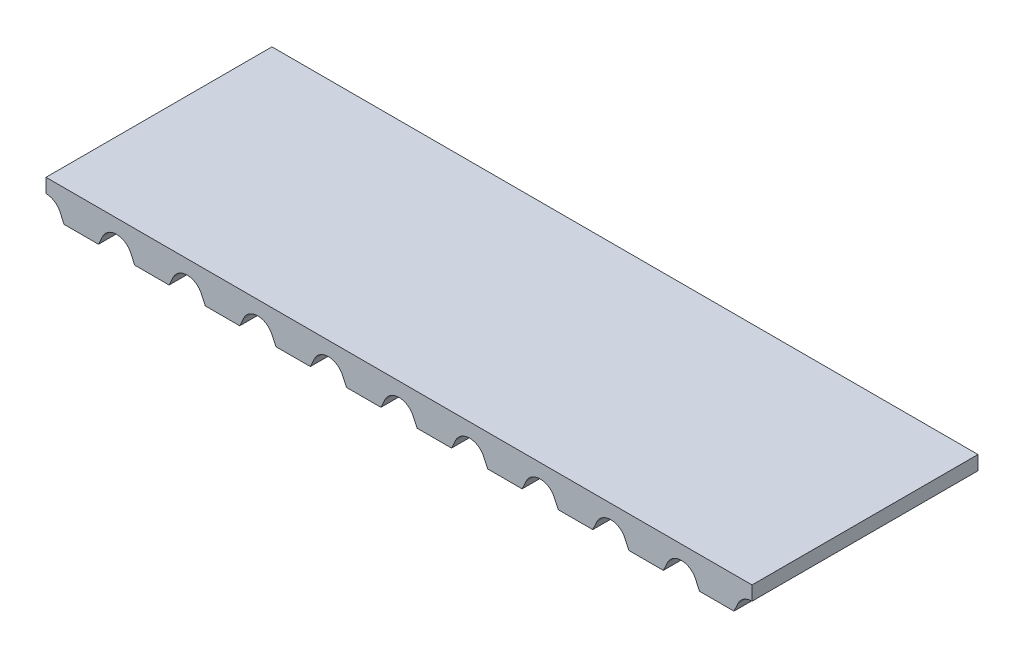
from build123d import *

# Parameters (mm, degrees)
EXTRUDE1_DEPTH        = 16
NUMBER_OF_TEETH_COUNT = 10
NUMBER_OF_TEETH_PITCH = 10


with BuildPart() as part:
    # Sketch1 → Extrude1 (new, symmetric)
    with BuildSketch(Plane.XY):
        with BuildLine():
            Line((-5, 0), (5, 0))
            Line((5, 0), (5, -2))
            ThreePointArc((5, -2), (3.821912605, -2.343540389), (3.012831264, -3.266198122))
            Line((3.012831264, -3.266198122), (2.4375, -4.5))
            Line((2.4375, -4.5), (-2.4375, -4.5))
            Line((-2.4375, -4.5), (-3.012831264, -3.266198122))
            ThreePointArc((-3.012831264, -3.266198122), (-3.821912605, -2.343540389), (-5, -2))
            Line((-5, -2), (-5, 0))
        make_face()
    extrude1 = extrude(amount=EXTRUDE1_DEPTH, both=True)

    # NUMBER OF TEETH: Extrude1 ×10
    with Locations(*[(i * NUMBER_OF_TEETH_PITCH, 0, 0) for i in range(1, NUMBER_OF_TEETH_COUNT)]):
        add(extrude1)


solid = part.part
